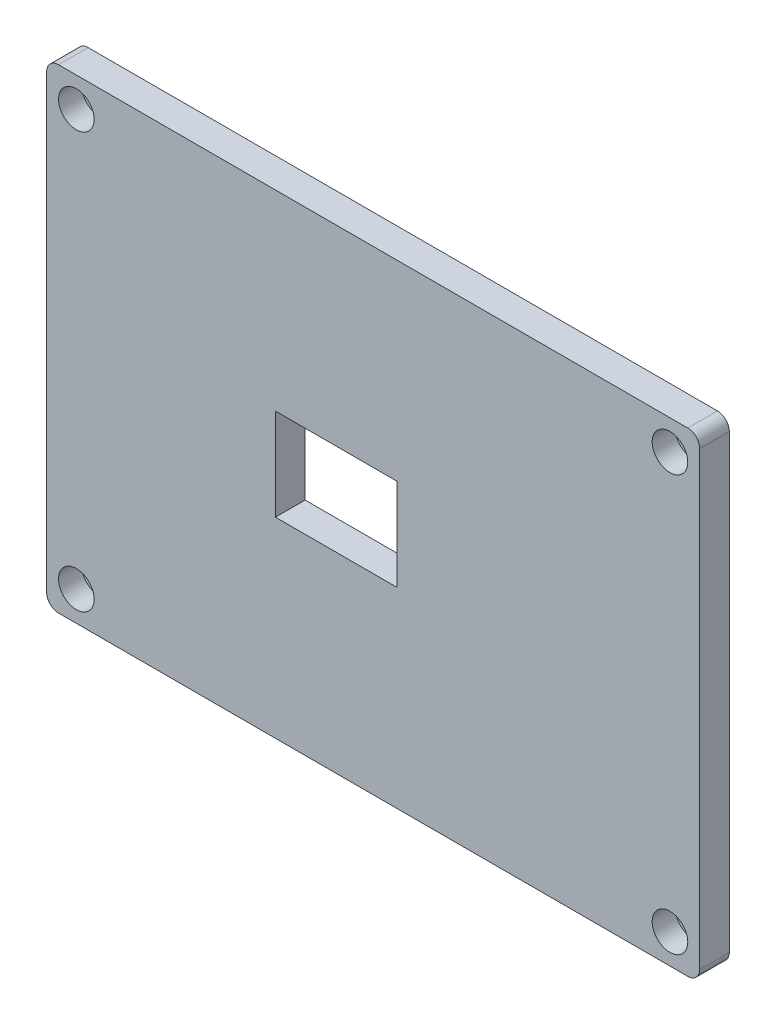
from build123d import *

# Parameters (mm, degrees)
SKETCH2_W               = 139.7
SKETCH2_H               = 101.6
SKETCH2_R               = 2.4765
BOSS_EXTRUDE1_DEPTH     = 6.35
SKETCH3_R               = 3.81
CUT_EXTRUDE1_DEPTH      = 4.953
FILLET1_R               = 2.54
CUT_EXTRUDE2_DEPTH      = 87.602453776
CUT_EXTRUDE2_DEPTH_BACK = 87.602453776
SKETCH5_W               = 26.018759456
SKETCH5_H               = 19.6596


with BuildPart() as part:
    # Sketch2 → Boss-Extrude1 (new body)
    with BuildSketch(Plane.XY):
        Rectangle(SKETCH2_W, SKETCH2_H)
        with Locations((-63.5, 44.45)):
            Circle(SKETCH2_R, mode=Mode.SUBTRACT)
        with Locations((63.5, 44.45)):
            Circle(SKETCH2_R, mode=Mode.SUBTRACT)
        with Locations((63.5, -44.45)):
            Circle(SKETCH2_R, mode=Mode.SUBTRACT)
        with Locations((-63.5, -44.45)):
            Circle(SKETCH2_R, mode=Mode.SUBTRACT)
    extrude(amount=BOSS_EXTRUDE1_DEPTH)

    # Sketch3 → Cut-Extrude1 (cut)
    with BuildSketch(Plane.XY.offset(6.35)):
        with Locations((-63.5, -44.45)):
            Circle(SKETCH3_R)
        with Locations((-63.5, 44.45)):
            Circle(SKETCH3_R)
        with Locations((63.5, 44.45)):
            Circle(SKETCH3_R)
        with Locations((63.5, -44.45)):
            Circle(SKETCH3_R)
    extrude(amount=-CUT_EXTRUDE1_DEPTH, mode=Mode.SUBTRACT)

    # Fillet1
    fillet1_edges = [part.edges().sort_by_distance(p)[0] for p in [
        (69.85, -50.8, 3.175),
        (-69.85, -50.8, 3.175),
        (-69.85, 50.8, 3.175),
        (69.85, 50.8, 3.175),
    ]]
    fillet(fillet1_edges, radius=FILLET1_R)

    # Sketch5 → Cut-Extrude2 (cut, two sides: drawn at the far end of the back side and taken through both)
    with BuildSketch(Plane.XY.offset(6.35).offset(-CUT_EXTRUDE2_DEPTH_BACK)):
        with Locations((-7.906370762, 0)):
            Rectangle(SKETCH5_W, SKETCH5_H)
    extrude(amount=CUT_EXTRUDE2_DEPTH + CUT_EXTRUDE2_DEPTH_BACK, mode=Mode.SUBTRACT)


solid = part.part
